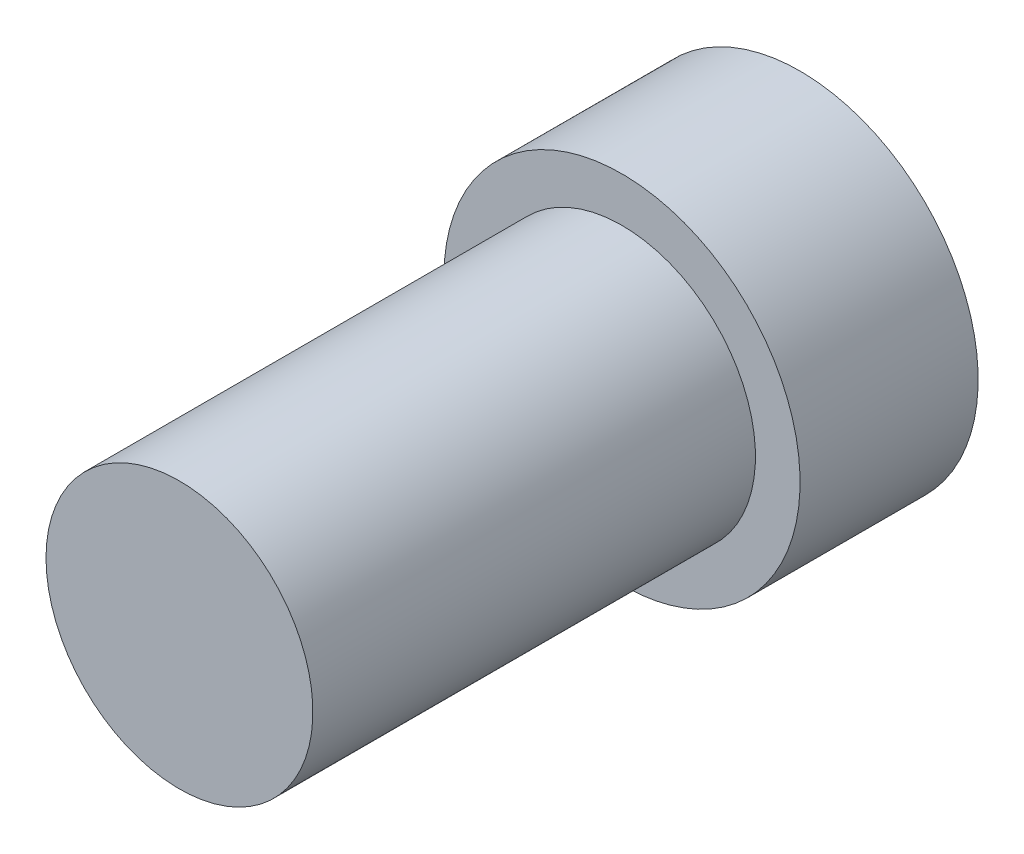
ISO-10303-21;
HEADER;
FILE_DESCRIPTION(('STEP AP214'),'2;1');
FILE_NAME('part.step','',(''),(''),'','','');
FILE_SCHEMA(('AUTOMOTIVE_DESIGN { 1 0 10303 214 1 1 1 1 }'));
ENDSEC;
DATA;
#1=APPLICATION_CONTEXT('core data for automotive mechanical design processes');
#2=APPLICATION_PROTOCOL_DEFINITION('international standard','automotive_design',2000,#1);
#3=PRODUCT_CONTEXT('',#1,'mechanical');
#4=PRODUCT('Part','Part','',(#3));
#5=PRODUCT_RELATED_PRODUCT_CATEGORY('part','',(#4));
#6=PRODUCT_DEFINITION_FORMATION('','',#4);
#7=PRODUCT_DEFINITION_CONTEXT('part definition',#1,'design');
#8=PRODUCT_DEFINITION('design','',#6,#7);
#9=PRODUCT_DEFINITION_SHAPE('','',#8);
#10=(LENGTH_UNIT() NAMED_UNIT(*) SI_UNIT(.MILLI.,.METRE.));
#11=(NAMED_UNIT(*) PLANE_ANGLE_UNIT() SI_UNIT($,.RADIAN.));
#12=(NAMED_UNIT(*) SI_UNIT($,.STERADIAN.) SOLID_ANGLE_UNIT());
#13=UNCERTAINTY_MEASURE_WITH_UNIT(LENGTH_MEASURE(1.E-05),#10,'distance_accuracy_value','');
#14=(GEOMETRIC_REPRESENTATION_CONTEXT(3) GLOBAL_UNCERTAINTY_ASSIGNED_CONTEXT((#13)) GLOBAL_UNIT_ASSIGNED_CONTEXT((#10,
#11,#12)) REPRESENTATION_CONTEXT('',''));
#15=CARTESIAN_POINT('',(0.,0.,0.));
#16=DIRECTION('',(0.,0.,1.));
#17=DIRECTION('',(1.,0.,0.));
#18=AXIS2_PLACEMENT_3D('',#15,#16,#17);
#19=CARTESIAN_POINT('',(0.,0.,-16.5467541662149));
#20=DIRECTION('',(0.,0.,-1.));
#21=DIRECTION('',(-1.,0.,0.));
#22=AXIS2_PLACEMENT_3D('',#19,#20,#21);
#23=CYLINDRICAL_SURFACE('',#22,9.525);
#24=CARTESIAN_POINT('',(0.,0.,-9.525));
#25=DIRECTION('',(0.,0.,-1.));
#26=DIRECTION('',(-1.,0.,0.));
#27=AXIS2_PLACEMENT_3D('',#24,#25,#26);
#28=CIRCLE('',#27,9.525);
#29=CARTESIAN_POINT('',(-9.525,0.,-9.525));
#30=VERTEX_POINT('',#29);
#31=EDGE_CURVE('E62',#30,#30,#28,.T.);
#32=ORIENTED_EDGE('',*,*,#31,.F.);
#33=EDGE_LOOP('',(#32));
#34=FACE_BOUND('',#33,.T.);
#35=CARTESIAN_POINT('',(0.,0.,0.));
#36=DIRECTION('',(0.,0.,-1.));
#37=DIRECTION('',(-1.,0.,0.));
#38=AXIS2_PLACEMENT_3D('',#35,#36,#37);
#39=CIRCLE('',#38,9.525);
#40=CARTESIAN_POINT('',(-9.525,0.,0.));
#41=VERTEX_POINT('',#40);
#42=EDGE_CURVE('E10',#41,#41,#39,.T.);
#43=ORIENTED_EDGE('',*,*,#42,.T.);
#44=EDGE_LOOP('',(#43));
#45=FACE_BOUND('',#44,.T.);
#46=ADVANCED_FACE('F45',(#34,#45),#23,.T.);
#47=CARTESIAN_POINT('',(-7.13739999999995,0.,0.));
#48=DIRECTION('',(0.,0.,-1.));
#49=DIRECTION('',(-1.,0.,0.));
#50=AXIS2_PLACEMENT_3D('',#47,#48,#49);
#51=PLANE('',#50);
#52=ORIENTED_EDGE('',*,*,#42,.F.);
#53=EDGE_LOOP('',(#52));
#54=FACE_BOUND('',#53,.T.);
#55=CARTESIAN_POINT('',(0.,0.,0.));
#56=DIRECTION('',(0.,0.,-1.));
#57=DIRECTION('',(-1.,0.,0.));
#58=AXIS2_PLACEMENT_3D('',#55,#56,#57);
#59=CIRCLE('',#58,7.13739999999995);
#60=CARTESIAN_POINT('',(-7.13739999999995,0.,0.));
#61=VERTEX_POINT('',#60);
#62=EDGE_CURVE('E52',#61,#61,#59,.T.);
#63=ORIENTED_EDGE('',*,*,#62,.T.);
#64=EDGE_LOOP('',(#63));
#65=FACE_BOUND('',#64,.T.);
#66=ADVANCED_FACE('F72',(#54,#65),#51,.F.);
#67=CARTESIAN_POINT('',(0.,0.,-16.5467541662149));
#68=DIRECTION('',(0.,0.,-1.));
#69=DIRECTION('',(-1.,0.,0.));
#70=AXIS2_PLACEMENT_3D('',#67,#68,#69);
#71=CYLINDRICAL_SURFACE('',#70,7.13739999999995);
#72=ORIENTED_EDGE('',*,*,#62,.F.);
#73=EDGE_LOOP('',(#72));
#74=FACE_BOUND('',#73,.T.);
#75=CARTESIAN_POINT('',(0.,0.,23.6728));
#76=DIRECTION('',(0.,0.,-1.));
#77=DIRECTION('',(-1.,0.,0.));
#78=AXIS2_PLACEMENT_3D('',#75,#76,#77);
#79=CIRCLE('',#78,7.13739999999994);
#80=CARTESIAN_POINT('',(-7.13739999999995,0.,23.6728));
#81=VERTEX_POINT('',#80);
#82=EDGE_CURVE('E57',#81,#81,#79,.T.);
#83=ORIENTED_EDGE('',*,*,#82,.T.);
#84=EDGE_LOOP('',(#83));
#85=FACE_BOUND('',#84,.T.);
#86=ADVANCED_FACE('F77',(#74,#85),#71,.T.);
#87=CARTESIAN_POINT('',(0.,0.,23.6728));
#88=DIRECTION('',(0.,0.,-1.));
#89=DIRECTION('',(-1.,0.,0.));
#90=AXIS2_PLACEMENT_3D('',#87,#88,#89);
#91=PLANE('',#90);
#92=ORIENTED_EDGE('',*,*,#82,.F.);
#93=EDGE_LOOP('',(#92));
#94=FACE_BOUND('',#93,.T.);
#95=ADVANCED_FACE('F81',(#94),#91,.F.);
#96=CARTESIAN_POINT('',(0.,0.,-9.525));
#97=DIRECTION('',(0.,0.,1.));
#98=DIRECTION('',(1.,0.,0.));
#99=AXIS2_PLACEMENT_3D('',#96,#97,#98);
#100=PLANE('',#99);
#101=ORIENTED_EDGE('',*,*,#31,.T.);
#102=EDGE_LOOP('',(#101));
#103=FACE_BOUND('',#102,.T.);
#104=ADVANCED_FACE('F69',(#103),#100,.F.);
#105=CLOSED_SHELL('',(#46,#66,#86,#95,#104));
#106=MANIFOLD_SOLID_BREP('B2',#105);
#107=ADVANCED_BREP_SHAPE_REPRESENTATION('',(#18,#106),#14);
#108=SHAPE_DEFINITION_REPRESENTATION(#9,#107);
ENDSEC;
END-ISO-10303-21;
